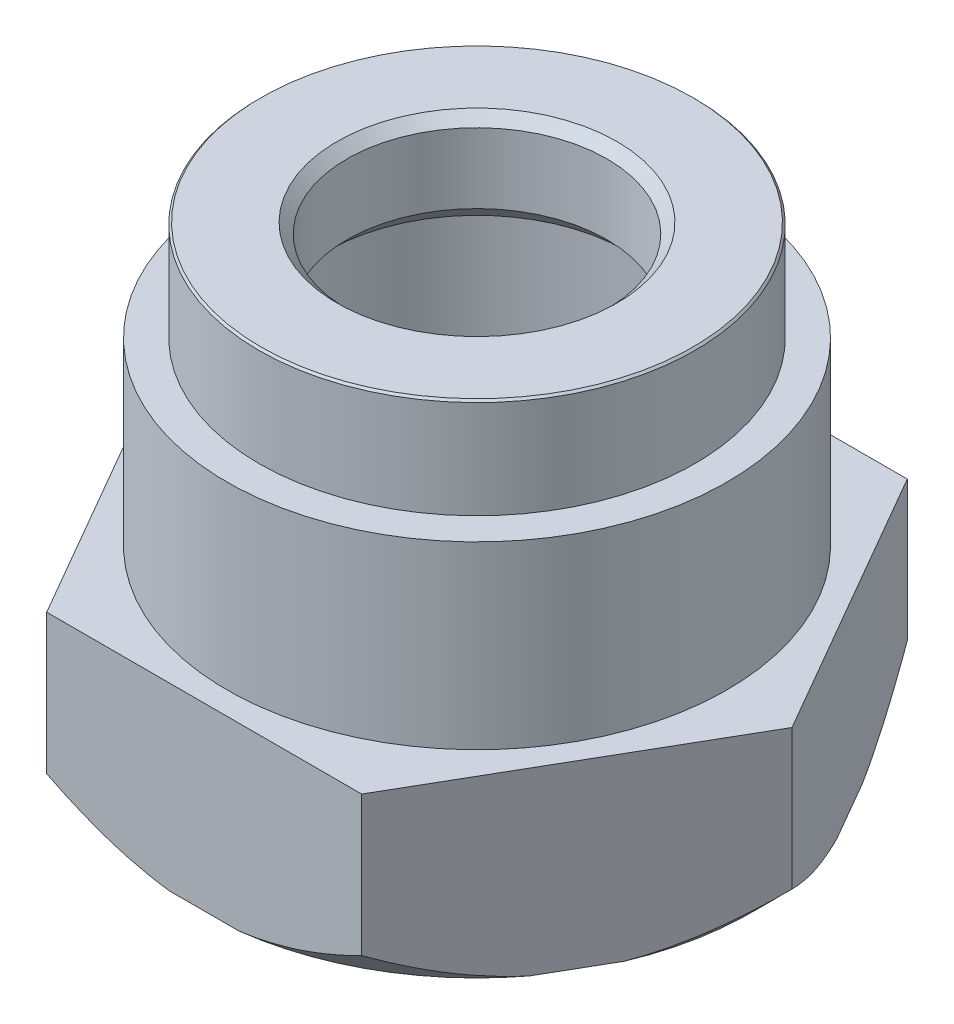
from build123d import *

# Parameters (mm, degrees)
CHANFREIN_CROU_SIZE = 2
ESQUISSE2_OUTSIDE_W = 43.526
ESQUISSE2_OUTSIDE_H = 43.526
ECROU_DEPTH         = 33.0175733


with BuildPart() as part:
    # Esquisse1 → Base-R_volution (revolve)
    with BuildSketch(Plane.XY, mode=Mode.PRIVATE) as base_r_volution_sk:
        Polygon((6.5, 22.5), (7, 23), (10.8, 23), (10.9, 22.9), (10.9, 18), (12.5, 18), (12.5, 9), (15.75, 9), (15.75, 0), (10.3155, 0), (9.3155, 1), (9.3155, 18), (7.5, 18), (6.5, 19), align=None)
    revolve(base_r_volution_sk.sketch.rotate(Axis((0, 0, 0), (0, 1, 0)), 90), axis=Axis((0, 0, 0), (0, 1, 0)))

    # Chanfrein _crou
    chanfrein_crou_edges = [part.edges().sort_by_distance(p)[0] for p in [
        (0, 0, 15.75),
    ]]
    chamfer(chanfrein_crou_edges, length=CHANFREIN_CROU_SIZE)

    # Esquisse2 outside → Ecrou (cut, through all)
    with BuildSketch(Plane.XZ):
        Rectangle(ESQUISSE2_OUTSIDE_W, ESQUISSE2_OUTSIDE_H)
        Polygon((7.875, 13.63990011), (-7.875, 13.63990011), (-15.75, 0), (-7.875, -13.63990011), (7.875, -13.63990011), (15.75, 0), align=None, mode=Mode.SUBTRACT)
    extrude(amount=-ECROU_DEPTH, mode=Mode.SUBTRACT)


solid = part.part
